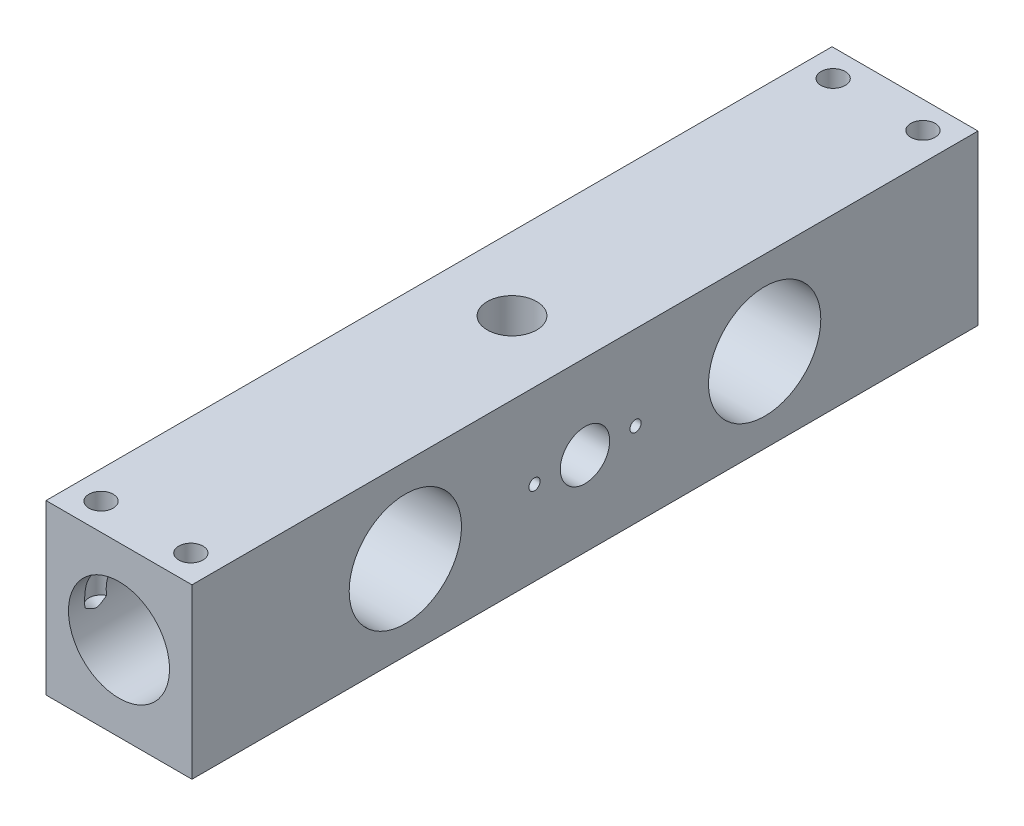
from build123d import *

# Parameters (mm, degrees)
ESQUISSE1_W                          = 65
ESQUISSE1_H                          = 75
EXTRUSION1_DEPTH                     = 175
ESQUISSE2_R                          = 25
ENL_V_MAT_EXTRU_1_DEPTH              = 202.183995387
DIAM_TRE_DU_PER_AGE_M25_0_25_1_D     = 45
DIAM_TRE_DU_PER_AGE_M25_0_25_1_DEPTH = 52
DIAM_TRE_DU_PER_AGE_M25_0_25_1_TIP   = 13.519363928
TROU_TARAUD_M12X1_251_D              = 10.8
TROU_TARAUD_M12X1_251_DEPTH          = 38.75
TROU_TARAUD_M12X1_251_TIP            = 3.244647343
TROU_TARAUD_M12X1_252_D              = 10.8
TROU_TARAUD_M12X1_252_DEPTH          = 40
TROU_TARAUD_M12X1_252_TIP            = 3.244647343
TROU_TARAUD_M12X1_253_D              = 10.8
TROU_TARAUD_M12X1_253_DEPTH          = 33.75
TROU_TARAUD_M12X1_253_TIP            = 3.244647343
TROU_TARAUD_M6X1_01_D                = 5
TROU_TARAUD_M6X1_01_DEPTH            = 15
TROU_TARAUD_M6X1_01_TIP              = 1.502151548
TROU_TARAUD_M6X1_01_ON_FACE_2_D      = 5
TROU_TARAUD_M6X1_01_ON_FACE_2_DEPTH  = 15
TROU_TARAUD_M6X1_01_ON_FACE_2_TIP    = 1.502151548
DIAM_TRE_DU_PER_AGE_M12_0_12_3_D     = 12
DIAM_TRE_DU_PER_AGE_M12_0_12_3_DEPTH = 30
DIAM_TRE_DU_PER_AGE_M12_0_12_3_TIP   = 3.605163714
DIAM_TRE_DU_PER_AGE_M22_0_22_1_D     = 22
DIAM_TRE_DU_PER_AGE_M22_0_22_2_D     = 22
DIAM_TRE_DU_PER_AGE_M22_0_22_2_DEPTH = 32.5
DIAM_TRE_DU_PER_AGE_M22_0_22_2_TIP   = 6.609466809


with BuildPart() as part:
    # Esquisse1 → Extrusion1 (new body)
    with BuildSketch(Plane.XY):
        with Locations((32.5, 37.5)):
            Rectangle(ESQUISSE1_W, ESQUISSE1_H)
    extrude(amount=-EXTRUSION1_DEPTH)

    # Esquisse2 → Enl_v. mat.-Extru.1 (cut, through all)
    with BuildSketch(Plane(origin=(65, 0, 0), x_dir=(0, 0, -1), z_dir=(1, 0, 0))):
        with Locations((80, 37.5)):
            Circle(ESQUISSE2_R)
    extrude(amount=-ENL_V_MAT_EXTRU_1_DEPTH, mode=Mode.SUBTRACT)

    # Diam_tre du per_age M25.0 _25_1
    with Locations(Plane(origin=(0, 0, -175), x_dir=(-1, 0, 0), z_dir=(0, 0, -1))):
        with Locations((-32.5, 37.5)):
            Hole(DIAM_TRE_DU_PER_AGE_M25_0_25_1_D / 2, depth=DIAM_TRE_DU_PER_AGE_M25_0_25_1_DEPTH)
            with Locations((0, 0, -(DIAM_TRE_DU_PER_AGE_M25_0_25_1_DEPTH + DIAM_TRE_DU_PER_AGE_M25_0_25_1_TIP / 2))):  # 118° drill point
                Cone(0, DIAM_TRE_DU_PER_AGE_M25_0_25_1_D / 2, DIAM_TRE_DU_PER_AGE_M25_0_25_1_TIP, mode=Mode.SUBTRACT)

    # Trou taraud_ M12x1.251
    with Locations(Plane(origin=(0, 75, 0), x_dir=(-1, 0, 0), z_dir=(0, 1, 0))):
        with Locations((-52.5, -163)):
            Hole(TROU_TARAUD_M12X1_251_D / 2, depth=TROU_TARAUD_M12X1_251_DEPTH)
            with Locations((0, 0, -(TROU_TARAUD_M12X1_251_DEPTH + TROU_TARAUD_M12X1_251_TIP / 2))):  # 118° drill point
                Cone(0, TROU_TARAUD_M12X1_251_D / 2, TROU_TARAUD_M12X1_251_TIP, mode=Mode.SUBTRACT)

    # Trou taraud_ M12x1.252
    with Locations(Plane(origin=(0, 75, 0), x_dir=(-1, 0, 0), z_dir=(0, 1, 0))):
        with Locations((-12.5, -163)):
            Hole(TROU_TARAUD_M12X1_252_D / 2, depth=TROU_TARAUD_M12X1_252_DEPTH)
            with Locations((0, 0, -(TROU_TARAUD_M12X1_252_DEPTH + TROU_TARAUD_M12X1_252_TIP / 2))):  # 118° drill point
                Cone(0, TROU_TARAUD_M12X1_252_D / 2, TROU_TARAUD_M12X1_252_TIP, mode=Mode.SUBTRACT)

    # Trou taraud_ M12x1.253
    with Locations(Plane(origin=(10, 0, -112), x_dir=(0, 0, -1), z_dir=(0, -1, 0))):
        with Locations((0, 0), (0, 45)):
            Hole(TROU_TARAUD_M12X1_253_D / 2, depth=TROU_TARAUD_M12X1_253_DEPTH)
            with Locations((0, 0, -(TROU_TARAUD_M12X1_253_DEPTH + TROU_TARAUD_M12X1_253_TIP / 2))):  # 118° drill point
                Cone(0, TROU_TARAUD_M12X1_253_D / 2, TROU_TARAUD_M12X1_253_TIP, mode=Mode.SUBTRACT)

    # Trou taraud_ M6x1.01
    with Locations(Plane(origin=(65, 37.5, -22.5), x_dir=(0, 0, 1), z_dir=(1, 0, 0))):
        with Locations((0, 0)):
            Hole(TROU_TARAUD_M6X1_01_D / 2, depth=TROU_TARAUD_M6X1_01_DEPTH)
            with Locations((0, 0, -(TROU_TARAUD_M6X1_01_DEPTH + TROU_TARAUD_M6X1_01_TIP / 2))):  # 118° drill point
                Cone(0, TROU_TARAUD_M6X1_01_D / 2, TROU_TARAUD_M6X1_01_TIP, mode=Mode.SUBTRACT)

    # Trou taraud_ M6x1.01 on face 2
    with Locations(Plane(origin=(0, 37.5, -18), x_dir=(0, 0, -1), z_dir=(-1, 0, 0))):
        with Locations((0, 0)):
            Hole(TROU_TARAUD_M6X1_01_ON_FACE_2_D / 2, depth=TROU_TARAUD_M6X1_01_ON_FACE_2_DEPTH)
            with Locations((0, 0, -(TROU_TARAUD_M6X1_01_ON_FACE_2_DEPTH + TROU_TARAUD_M6X1_01_ON_FACE_2_TIP / 2))):  # 118° drill point
                Cone(0, TROU_TARAUD_M6X1_01_ON_FACE_2_D / 2, TROU_TARAUD_M6X1_01_ON_FACE_2_TIP, mode=Mode.SUBTRACT)

    # Diam_tre du per_age M12.0 _12_3
    with Locations(Plane.XZ):
        with Locations((32.5, -24)):
            Hole(DIAM_TRE_DU_PER_AGE_M12_0_12_3_D / 2, depth=DIAM_TRE_DU_PER_AGE_M12_0_12_3_DEPTH)
            with Locations((0, 0, -(DIAM_TRE_DU_PER_AGE_M12_0_12_3_DEPTH + DIAM_TRE_DU_PER_AGE_M12_0_12_3_TIP / 2))):  # 118° drill point
                Cone(0, DIAM_TRE_DU_PER_AGE_M12_0_12_3_D / 2, DIAM_TRE_DU_PER_AGE_M12_0_12_3_TIP, mode=Mode.SUBTRACT)

    # Sym_trie1: part across plane


with BuildPart() as part_1:
    add(part.part)
    add(part.part.mirror(Plane(origin=(0, 75, 0), x_dir=(1, 0, 0), z_dir=(0, 0, -1))))

    # Diam_tre du per_age M22.0 _22_1 (through all)
    with Locations(Plane.XZ):
        with Locations((32.5, 0)):
            Hole(DIAM_TRE_DU_PER_AGE_M22_0_22_1_D / 2)

    # Diam_tre du per_age M22.0 _22_2
    with Locations(Plane(origin=(65, 0, 0), x_dir=(0, 0, -1), z_dir=(1, 0, 0))):
        with Locations((0, 37.5)):
            Hole(DIAM_TRE_DU_PER_AGE_M22_0_22_2_D / 2, depth=DIAM_TRE_DU_PER_AGE_M22_0_22_2_DEPTH)
            with Locations((0, 0, -(DIAM_TRE_DU_PER_AGE_M22_0_22_2_DEPTH + DIAM_TRE_DU_PER_AGE_M22_0_22_2_TIP / 2))):  # 118° drill point
                Cone(0, DIAM_TRE_DU_PER_AGE_M22_0_22_2_D / 2, DIAM_TRE_DU_PER_AGE_M22_0_22_2_TIP, mode=Mode.SUBTRACT)


solid = part_1.part
